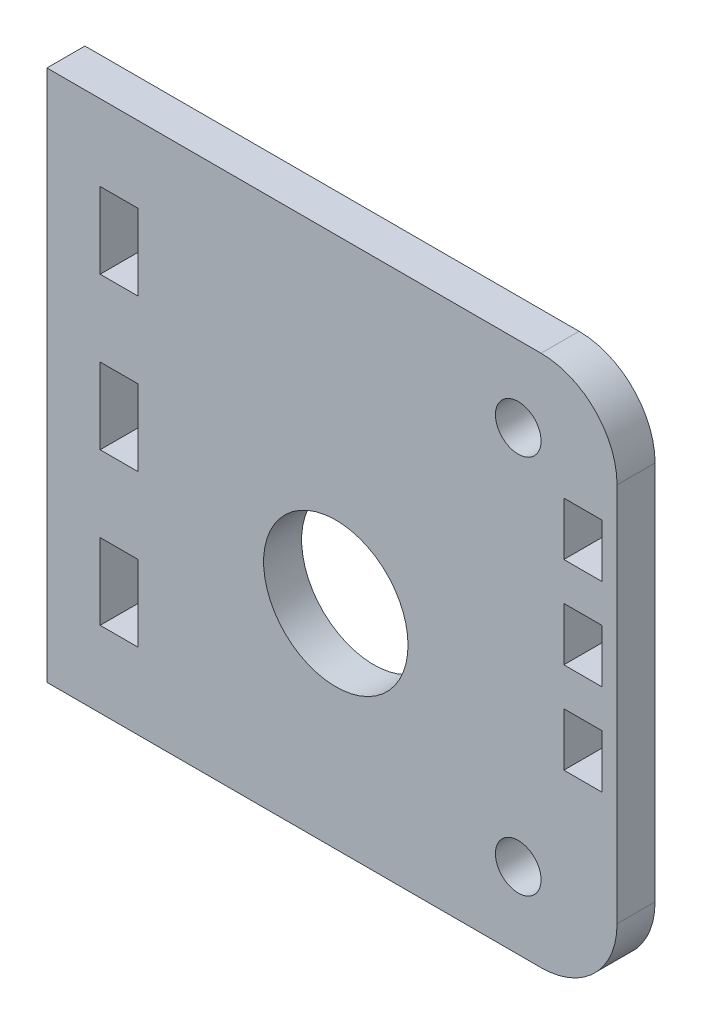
ISO-10303-21;
HEADER;
FILE_DESCRIPTION(('STEP AP214'),'2;1');
FILE_NAME('part.step','',(''),(''),'','','');
FILE_SCHEMA(('AUTOMOTIVE_DESIGN { 1 0 10303 214 1 1 1 1 }'));
ENDSEC;
DATA;
#1=APPLICATION_CONTEXT('core data for automotive mechanical design processes');
#2=APPLICATION_PROTOCOL_DEFINITION('international standard','automotive_design',2000,#1);
#3=PRODUCT_CONTEXT('',#1,'mechanical');
#4=PRODUCT('Part','Part','',(#3));
#5=PRODUCT_RELATED_PRODUCT_CATEGORY('part','',(#4));
#6=PRODUCT_DEFINITION_FORMATION('','',#4);
#7=PRODUCT_DEFINITION_CONTEXT('part definition',#1,'design');
#8=PRODUCT_DEFINITION('design','',#6,#7);
#9=PRODUCT_DEFINITION_SHAPE('','',#8);
#10=(LENGTH_UNIT() NAMED_UNIT(*) SI_UNIT(.MILLI.,.METRE.));
#11=(NAMED_UNIT(*) PLANE_ANGLE_UNIT() SI_UNIT($,.RADIAN.));
#12=(NAMED_UNIT(*) SI_UNIT($,.STERADIAN.) SOLID_ANGLE_UNIT());
#13=UNCERTAINTY_MEASURE_WITH_UNIT(LENGTH_MEASURE(1.E-05),#10,'distance_accuracy_value','');
#14=(GEOMETRIC_REPRESENTATION_CONTEXT(3) GLOBAL_UNCERTAINTY_ASSIGNED_CONTEXT((#13)) GLOBAL_UNIT_ASSIGNED_CONTEXT((#10,
#11,#12)) REPRESENTATION_CONTEXT('',''));
#15=CARTESIAN_POINT('',(0.,0.,0.));
#16=DIRECTION('',(0.,0.,1.));
#17=DIRECTION('',(1.,0.,0.));
#18=AXIS2_PLACEMENT_3D('',#15,#16,#17);
#19=CARTESIAN_POINT('',(0.,0.,5.));
#20=DIRECTION('',(0.,0.,1.));
#21=DIRECTION('',(1.,0.,0.));
#22=AXIS2_PLACEMENT_3D('',#19,#20,#21);
#23=PLANE('',#22);
#24=CARTESIAN_POINT('',(-12.,-7.,5.));
#25=DIRECTION('',(0.,0.,1.));
#26=DIRECTION('',(1.,0.,0.));
#27=AXIS2_PLACEMENT_3D('',#24,#25,#26);
#28=CIRCLE('',#27,9.5);
#29=CARTESIAN_POINT('',(-2.5,-7.,5.));
#30=VERTEX_POINT('',#29);
#31=EDGE_CURVE('E923',#30,#30,#28,.T.);
#32=ORIENTED_EDGE('',*,*,#31,.F.);
#33=EDGE_LOOP('',(#32));
#34=FACE_BOUND('',#33,.T.);
#35=DIRECTION('',(0.,-1.,0.));
#36=VECTOR('',#35,1.);
#37=CARTESIAN_POINT('',(-43.,-15.,5.));
#38=LINE('',#37,#36);
#39=CARTESIAN_POINT('',(-43.,-15.,5.));
#40=VERTEX_POINT('',#39);
#41=CARTESIAN_POINT('',(-43.,-25.,5.));
#42=VERTEX_POINT('',#41);
#43=EDGE_CURVE('E53',#40,#42,#38,.T.);
#44=ORIENTED_EDGE('',*,*,#43,.F.);
#45=DIRECTION('',(-1.,0.,0.));
#46=VECTOR('',#45,1.);
#47=CARTESIAN_POINT('',(-43.,-15.,5.));
#48=LINE('',#47,#46);
#49=CARTESIAN_POINT('',(-38.,-15.,5.));
#50=VERTEX_POINT('',#49);
#51=EDGE_CURVE('E253',#50,#40,#48,.T.);
#52=ORIENTED_EDGE('',*,*,#51,.F.);
#53=DIRECTION('',(0.,1.,0.));
#54=VECTOR('',#53,1.);
#55=CARTESIAN_POINT('',(-38.,-15.,5.));
#56=LINE('',#55,#54);
#57=CARTESIAN_POINT('',(-38.,-25.,5.));
#58=VERTEX_POINT('',#57);
#59=EDGE_CURVE('E238',#58,#50,#56,.T.);
#60=ORIENTED_EDGE('',*,*,#59,.F.);
#61=DIRECTION('',(1.,0.,0.));
#62=VECTOR('',#61,1.);
#63=CARTESIAN_POINT('',(-43.,-25.,5.));
#64=LINE('',#63,#62);
#65=EDGE_CURVE('E247',#42,#58,#64,.T.);
#66=ORIENTED_EDGE('',*,*,#65,.F.);
#67=EDGE_LOOP('',(#44,#52,#60,#66));
#68=FACE_BOUND('',#67,.T.);
#69=DIRECTION('',(0.,-1.,0.));
#70=VECTOR('',#69,1.);
#71=CARTESIAN_POINT('',(-43.,4.99999999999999,5.));
#72=LINE('',#71,#70);
#73=CARTESIAN_POINT('',(-43.,4.99999999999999,5.));
#74=VERTEX_POINT('',#73);
#75=CARTESIAN_POINT('',(-43.,-5.00000000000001,5.));
#76=VERTEX_POINT('',#75);
#77=EDGE_CURVE('E260',#74,#76,#72,.T.);
#78=ORIENTED_EDGE('',*,*,#77,.F.);
#79=DIRECTION('',(-1.,0.,0.));
#80=VECTOR('',#79,1.);
#81=CARTESIAN_POINT('',(-43.,4.99999999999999,5.));
#82=LINE('',#81,#80);
#83=CARTESIAN_POINT('',(-38.,4.99999999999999,5.));
#84=VERTEX_POINT('',#83);
#85=EDGE_CURVE('E270',#84,#74,#82,.T.);
#86=ORIENTED_EDGE('',*,*,#85,.F.);
#87=DIRECTION('',(0.,1.,0.));
#88=VECTOR('',#87,1.);
#89=CARTESIAN_POINT('',(-38.,4.99999999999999,5.));
#90=LINE('',#89,#88);
#91=CARTESIAN_POINT('',(-38.,-5.00000000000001,5.));
#92=VERTEX_POINT('',#91);
#93=EDGE_CURVE('E267',#92,#84,#90,.T.);
#94=ORIENTED_EDGE('',*,*,#93,.F.);
#95=DIRECTION('',(1.,0.,0.));
#96=VECTOR('',#95,1.);
#97=CARTESIAN_POINT('',(-43.,-5.00000000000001,5.));
#98=LINE('',#97,#96);
#99=EDGE_CURVE('E264',#76,#92,#98,.T.);
#100=ORIENTED_EDGE('',*,*,#99,.F.);
#101=EDGE_LOOP('',(#78,#86,#94,#100));
#102=FACE_BOUND('',#101,.T.);
#103=DIRECTION('',(0.,-1.,0.));
#104=VECTOR('',#103,1.);
#105=CARTESIAN_POINT('',(-43.,25.,5.));
#106=LINE('',#105,#104);
#107=CARTESIAN_POINT('',(-43.,25.,5.));
#108=VERTEX_POINT('',#107);
#109=CARTESIAN_POINT('',(-43.,15.,5.));
#110=VERTEX_POINT('',#109);
#111=EDGE_CURVE('E276',#108,#110,#106,.T.);
#112=ORIENTED_EDGE('',*,*,#111,.F.);
#113=DIRECTION('',(-1.,0.,0.));
#114=VECTOR('',#113,1.);
#115=CARTESIAN_POINT('',(-43.,25.,5.));
#116=LINE('',#115,#114);
#117=CARTESIAN_POINT('',(-38.,25.,5.));
#118=VERTEX_POINT('',#117);
#119=EDGE_CURVE('E290',#118,#108,#116,.T.);
#120=ORIENTED_EDGE('',*,*,#119,.F.);
#121=DIRECTION('',(0.,1.,0.));
#122=VECTOR('',#121,1.);
#123=CARTESIAN_POINT('',(-38.,25.,5.));
#124=LINE('',#123,#122);
#125=CARTESIAN_POINT('',(-38.,15.,5.));
#126=VERTEX_POINT('',#125);
#127=EDGE_CURVE('E287',#126,#118,#124,.T.);
#128=ORIENTED_EDGE('',*,*,#127,.F.);
#129=DIRECTION('',(1.,0.,0.));
#130=VECTOR('',#129,1.);
#131=CARTESIAN_POINT('',(-43.,15.,5.));
#132=LINE('',#131,#130);
#133=EDGE_CURVE('E284',#110,#126,#132,.T.);
#134=ORIENTED_EDGE('',*,*,#133,.F.);
#135=EDGE_LOOP('',(#112,#120,#128,#134));
#136=FACE_BOUND('',#135,.T.);
#137=DIRECTION('',(0.,-1.,0.));
#138=VECTOR('',#137,1.);
#139=CARTESIAN_POINT('',(18.,-4.,5.));
#140=LINE('',#139,#138);
#141=CARTESIAN_POINT('',(18.,-4.,5.));
#142=VERTEX_POINT('',#141);
#143=CARTESIAN_POINT('',(18.,-11.,5.));
#144=VERTEX_POINT('',#143);
#145=EDGE_CURVE('E296',#142,#144,#140,.T.);
#146=ORIENTED_EDGE('',*,*,#145,.F.);
#147=DIRECTION('',(-1.,0.,0.));
#148=VECTOR('',#147,1.);
#149=CARTESIAN_POINT('',(18.,-4.,5.));
#150=LINE('',#149,#148);
#151=CARTESIAN_POINT('',(23.,-4.,5.));
#152=VERTEX_POINT('',#151);
#153=EDGE_CURVE('E310',#152,#142,#150,.T.);
#154=ORIENTED_EDGE('',*,*,#153,.F.);
#155=DIRECTION('',(0.,1.,0.));
#156=VECTOR('',#155,1.);
#157=CARTESIAN_POINT('',(23.,-4.,5.));
#158=LINE('',#157,#156);
#159=CARTESIAN_POINT('',(23.,-11.,5.));
#160=VERTEX_POINT('',#159);
#161=EDGE_CURVE('E307',#160,#152,#158,.T.);
#162=ORIENTED_EDGE('',*,*,#161,.F.);
#163=DIRECTION('',(1.,0.,0.));
#164=VECTOR('',#163,1.);
#165=CARTESIAN_POINT('',(18.,-11.,5.));
#166=LINE('',#165,#164);
#167=EDGE_CURVE('E304',#144,#160,#166,.T.);
#168=ORIENTED_EDGE('',*,*,#167,.F.);
#169=EDGE_LOOP('',(#146,#154,#162,#168));
#170=FACE_BOUND('',#169,.T.);
#171=DIRECTION('',(0.,-1.,0.));
#172=VECTOR('',#171,1.);
#173=CARTESIAN_POINT('',(18.,8.,5.));
#174=LINE('',#173,#172);
#175=CARTESIAN_POINT('',(18.,8.,5.));
#176=VERTEX_POINT('',#175);
#177=CARTESIAN_POINT('',(18.,1.,5.));
#178=VERTEX_POINT('',#177);
#179=EDGE_CURVE('E316',#176,#178,#174,.T.);
#180=ORIENTED_EDGE('',*,*,#179,.F.);
#181=DIRECTION('',(-1.,0.,0.));
#182=VECTOR('',#181,1.);
#183=CARTESIAN_POINT('',(18.,8.,5.));
#184=LINE('',#183,#182);
#185=CARTESIAN_POINT('',(23.,8.,5.));
#186=VERTEX_POINT('',#185);
#187=EDGE_CURVE('E330',#186,#176,#184,.T.);
#188=ORIENTED_EDGE('',*,*,#187,.F.);
#189=DIRECTION('',(0.,1.,0.));
#190=VECTOR('',#189,1.);
#191=CARTESIAN_POINT('',(23.,8.,5.));
#192=LINE('',#191,#190);
#193=CARTESIAN_POINT('',(23.,1.,5.));
#194=VERTEX_POINT('',#193);
#195=EDGE_CURVE('E327',#194,#186,#192,.T.);
#196=ORIENTED_EDGE('',*,*,#195,.F.);
#197=DIRECTION('',(1.,0.,0.));
#198=VECTOR('',#197,1.);
#199=CARTESIAN_POINT('',(18.,1.,5.));
#200=LINE('',#199,#198);
#201=EDGE_CURVE('E324',#178,#194,#200,.T.);
#202=ORIENTED_EDGE('',*,*,#201,.F.);
#203=EDGE_LOOP('',(#180,#188,#196,#202));
#204=FACE_BOUND('',#203,.T.);
#205=DIRECTION('',(0.,-1.,0.));
#206=VECTOR('',#205,1.);
#207=CARTESIAN_POINT('',(18.,20.,5.));
#208=LINE('',#207,#206);
#209=CARTESIAN_POINT('',(18.,20.,5.));
#210=VERTEX_POINT('',#209);
#211=CARTESIAN_POINT('',(18.,13.,5.));
#212=VERTEX_POINT('',#211);
#213=EDGE_CURVE('E336',#210,#212,#208,.T.);
#214=ORIENTED_EDGE('',*,*,#213,.F.);
#215=DIRECTION('',(-1.,0.,0.));
#216=VECTOR('',#215,1.);
#217=CARTESIAN_POINT('',(18.,20.,5.));
#218=LINE('',#217,#216);
#219=CARTESIAN_POINT('',(23.,20.,5.));
#220=VERTEX_POINT('',#219);
#221=EDGE_CURVE('E350',#220,#210,#218,.T.);
#222=ORIENTED_EDGE('',*,*,#221,.F.);
#223=DIRECTION('',(0.,1.,0.));
#224=VECTOR('',#223,1.);
#225=CARTESIAN_POINT('',(23.,20.,5.));
#226=LINE('',#225,#224);
#227=CARTESIAN_POINT('',(23.,13.,5.));
#228=VERTEX_POINT('',#227);
#229=EDGE_CURVE('E347',#228,#220,#226,.T.);
#230=ORIENTED_EDGE('',*,*,#229,.F.);
#231=DIRECTION('',(1.,0.,0.));
#232=VECTOR('',#231,1.);
#233=CARTESIAN_POINT('',(18.,13.,5.));
#234=LINE('',#233,#232);
#235=EDGE_CURVE('E344',#212,#228,#234,.T.);
#236=ORIENTED_EDGE('',*,*,#235,.F.);
#237=EDGE_LOOP('',(#214,#222,#230,#236));
#238=FACE_BOUND('',#237,.T.);
#239=DIRECTION('',(-1.,0.,0.));
#240=VECTOR('',#239,1.);
#241=CARTESIAN_POINT('',(25.,35.,5.));
#242=LINE('',#241,#240);
#243=CARTESIAN_POINT('',(15.,35.,5.));
#244=VERTEX_POINT('',#243);
#245=CARTESIAN_POINT('',(-50.,35.,5.));
#246=VERTEX_POINT('',#245);
#247=EDGE_CURVE('E392',#244,#246,#242,.T.);
#248=ORIENTED_EDGE('',*,*,#247,.T.);
#249=DIRECTION('',(0.,1.,0.));
#250=VECTOR('',#249,1.);
#251=CARTESIAN_POINT('',(-50.,-35.,5.));
#252=LINE('',#251,#250);
#253=CARTESIAN_POINT('',(-50.,-35.,5.));
#254=VERTEX_POINT('',#253);
#255=EDGE_CURVE('E368',#254,#246,#252,.T.);
#256=ORIENTED_EDGE('',*,*,#255,.F.);
#257=DIRECTION('',(-1.,0.,0.));
#258=VECTOR('',#257,1.);
#259=CARTESIAN_POINT('',(25.,-35.,5.));
#260=LINE('',#259,#258);
#261=CARTESIAN_POINT('',(15.,-35.,5.));
#262=VERTEX_POINT('',#261);
#263=EDGE_CURVE('E398',#262,#254,#260,.T.);
#264=ORIENTED_EDGE('',*,*,#263,.F.);
#265=CARTESIAN_POINT('',(15.,-25.,5.));
#266=DIRECTION('',(0.,0.,1.));
#267=DIRECTION('',(1.,0.,0.));
#268=AXIS2_PLACEMENT_3D('',#265,#266,#267);
#269=CIRCLE('',#268,10.);
#270=CARTESIAN_POINT('',(25.,-25.,5.));
#271=VERTEX_POINT('',#270);
#272=EDGE_CURVE('E406',#262,#271,#269,.T.);
#273=ORIENTED_EDGE('',*,*,#272,.T.);
#274=DIRECTION('',(0.,-1.,0.));
#275=VECTOR('',#274,1.);
#276=CARTESIAN_POINT('',(25.,35.,5.));
#277=LINE('',#276,#275);
#278=CARTESIAN_POINT('',(25.,25.,5.));
#279=VERTEX_POINT('',#278);
#280=EDGE_CURVE('E384',#279,#271,#277,.T.);
#281=ORIENTED_EDGE('',*,*,#280,.F.);
#282=CARTESIAN_POINT('',(15.,25.,5.));
#283=DIRECTION('',(0.,0.,1.));
#284=DIRECTION('',(1.,0.,0.));
#285=AXIS2_PLACEMENT_3D('',#282,#283,#284);
#286=CIRCLE('',#285,10.);
#287=EDGE_CURVE('E408',#279,#244,#286,.T.);
#288=ORIENTED_EDGE('',*,*,#287,.T.);
#289=EDGE_LOOP('',(#248,#256,#264,#273,#281,#288));
#290=FACE_BOUND('',#289,.T.);
#291=CARTESIAN_POINT('',(12.,-25.,5.));
#292=DIRECTION('',(0.,0.,1.));
#293=DIRECTION('',(1.,0.,0.));
#294=AXIS2_PLACEMENT_3D('',#291,#292,#293);
#295=CIRCLE('',#294,3.);
#296=CARTESIAN_POINT('',(15.,-25.,5.));
#297=VERTEX_POINT('',#296);
#298=EDGE_CURVE('E374',#297,#297,#295,.T.);
#299=ORIENTED_EDGE('',*,*,#298,.F.);
#300=EDGE_LOOP('',(#299));
#301=FACE_BOUND('',#300,.T.);
#302=CARTESIAN_POINT('',(12.,25.,5.));
#303=DIRECTION('',(0.,0.,1.));
#304=DIRECTION('',(1.,0.,0.));
#305=AXIS2_PLACEMENT_3D('',#302,#303,#304);
#306=CIRCLE('',#305,3.);
#307=CARTESIAN_POINT('',(15.,25.,5.));
#308=VERTEX_POINT('',#307);
#309=EDGE_CURVE('E378',#308,#308,#306,.T.);
#310=ORIENTED_EDGE('',*,*,#309,.F.);
#311=EDGE_LOOP('',(#310));
#312=FACE_BOUND('',#311,.T.);
#313=ADVANCED_FACE('F37',(#34,#68,#102,#136,#170,#204,#238,#290,#301,#312),#23,.T.);
#314=CARTESIAN_POINT('',(0.,0.,0.));
#315=DIRECTION('',(0.,0.,1.));
#316=DIRECTION('',(1.,0.,0.));
#317=AXIS2_PLACEMENT_3D('',#314,#315,#316);
#318=PLANE('',#317);
#319=CARTESIAN_POINT('',(-12.,-7.,0.));
#320=DIRECTION('',(0.,0.,1.));
#321=DIRECTION('',(1.,0.,0.));
#322=AXIS2_PLACEMENT_3D('',#319,#320,#321);
#323=CIRCLE('',#322,9.5);
#324=CARTESIAN_POINT('',(-2.5,-7.,0.));
#325=VERTEX_POINT('',#324);
#326=EDGE_CURVE('E41',#325,#325,#323,.T.);
#327=ORIENTED_EDGE('',*,*,#326,.T.);
#328=EDGE_LOOP('',(#327));
#329=FACE_BOUND('',#328,.T.);
#330=DIRECTION('',(-1.,0.,0.));
#331=VECTOR('',#330,1.);
#332=CARTESIAN_POINT('',(0.,-15.,0.));
#333=LINE('',#332,#331);
#334=CARTESIAN_POINT('',(-38.,-15.,0.));
#335=VERTEX_POINT('',#334);
#336=CARTESIAN_POINT('',(-43.,-15.,0.));
#337=VERTEX_POINT('',#336);
#338=EDGE_CURVE('E46',#335,#337,#333,.T.);
#339=ORIENTED_EDGE('',*,*,#338,.T.);
#340=DIRECTION('',(0.,-1.,0.));
#341=VECTOR('',#340,1.);
#342=CARTESIAN_POINT('',(-43.,0.,0.));
#343=LINE('',#342,#341);
#344=CARTESIAN_POINT('',(-43.,-25.,0.));
#345=VERTEX_POINT('',#344);
#346=EDGE_CURVE('E11',#337,#345,#343,.T.);
#347=ORIENTED_EDGE('',*,*,#346,.T.);
#348=DIRECTION('',(1.,0.,0.));
#349=VECTOR('',#348,1.);
#350=CARTESIAN_POINT('',(0.,-25.,0.));
#351=LINE('',#350,#349);
#352=CARTESIAN_POINT('',(-38.,-25.,0.));
#353=VERTEX_POINT('',#352);
#354=EDGE_CURVE('E478',#345,#353,#351,.T.);
#355=ORIENTED_EDGE('',*,*,#354,.T.);
#356=DIRECTION('',(0.,1.,0.));
#357=VECTOR('',#356,1.);
#358=CARTESIAN_POINT('',(-38.,0.,0.));
#359=LINE('',#358,#357);
#360=EDGE_CURVE('E241',#353,#335,#359,.T.);
#361=ORIENTED_EDGE('',*,*,#360,.T.);
#362=EDGE_LOOP('',(#339,#347,#355,#361));
#363=FACE_BOUND('',#362,.T.);
#364=DIRECTION('',(-1.,0.,0.));
#365=VECTOR('',#364,1.);
#366=CARTESIAN_POINT('',(0.,4.99999999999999,0.));
#367=LINE('',#366,#365);
#368=CARTESIAN_POINT('',(-38.,4.99999999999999,0.));
#369=VERTEX_POINT('',#368);
#370=CARTESIAN_POINT('',(-43.,4.99999999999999,0.));
#371=VERTEX_POINT('',#370);
#372=EDGE_CURVE('E472',#369,#371,#367,.T.);
#373=ORIENTED_EDGE('',*,*,#372,.T.);
#374=DIRECTION('',(0.,-1.,0.));
#375=VECTOR('',#374,1.);
#376=CARTESIAN_POINT('',(-43.,0.,0.));
#377=LINE('',#376,#375);
#378=CARTESIAN_POINT('',(-43.,-5.00000000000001,0.));
#379=VERTEX_POINT('',#378);
#380=EDGE_CURVE('E475',#371,#379,#377,.T.);
#381=ORIENTED_EDGE('',*,*,#380,.T.);
#382=DIRECTION('',(1.,0.,0.));
#383=VECTOR('',#382,1.);
#384=CARTESIAN_POINT('',(0.,-5.00000000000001,0.));
#385=LINE('',#384,#383);
#386=CARTESIAN_POINT('',(-38.,-5.00000000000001,0.));
#387=VERTEX_POINT('',#386);
#388=EDGE_CURVE('E466',#379,#387,#385,.T.);
#389=ORIENTED_EDGE('',*,*,#388,.T.);
#390=DIRECTION('',(0.,1.,0.));
#391=VECTOR('',#390,1.);
#392=CARTESIAN_POINT('',(-38.,0.,0.));
#393=LINE('',#392,#391);
#394=EDGE_CURVE('E469',#387,#369,#393,.T.);
#395=ORIENTED_EDGE('',*,*,#394,.T.);
#396=EDGE_LOOP('',(#373,#381,#389,#395));
#397=FACE_BOUND('',#396,.T.);
#398=DIRECTION('',(-1.,0.,0.));
#399=VECTOR('',#398,1.);
#400=CARTESIAN_POINT('',(0.,25.,0.));
#401=LINE('',#400,#399);
#402=CARTESIAN_POINT('',(-38.,25.,0.));
#403=VERTEX_POINT('',#402);
#404=CARTESIAN_POINT('',(-43.,25.,0.));
#405=VERTEX_POINT('',#404);
#406=EDGE_CURVE('E460',#403,#405,#401,.T.);
#407=ORIENTED_EDGE('',*,*,#406,.T.);
#408=DIRECTION('',(0.,-1.,0.));
#409=VECTOR('',#408,1.);
#410=CARTESIAN_POINT('',(-43.,0.,0.));
#411=LINE('',#410,#409);
#412=CARTESIAN_POINT('',(-43.,15.,0.));
#413=VERTEX_POINT('',#412);
#414=EDGE_CURVE('E463',#405,#413,#411,.T.);
#415=ORIENTED_EDGE('',*,*,#414,.T.);
#416=DIRECTION('',(1.,0.,0.));
#417=VECTOR('',#416,1.);
#418=CARTESIAN_POINT('',(0.,15.,0.));
#419=LINE('',#418,#417);
#420=CARTESIAN_POINT('',(-38.,15.,0.));
#421=VERTEX_POINT('',#420);
#422=EDGE_CURVE('E454',#413,#421,#419,.T.);
#423=ORIENTED_EDGE('',*,*,#422,.T.);
#424=DIRECTION('',(0.,1.,0.));
#425=VECTOR('',#424,1.);
#426=CARTESIAN_POINT('',(-38.,0.,0.));
#427=LINE('',#426,#425);
#428=EDGE_CURVE('E457',#421,#403,#427,.T.);
#429=ORIENTED_EDGE('',*,*,#428,.T.);
#430=EDGE_LOOP('',(#407,#415,#423,#429));
#431=FACE_BOUND('',#430,.T.);
#432=DIRECTION('',(-1.,0.,0.));
#433=VECTOR('',#432,1.);
#434=CARTESIAN_POINT('',(0.,-3.99999999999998,0.));
#435=LINE('',#434,#433);
#436=CARTESIAN_POINT('',(23.,-4.,0.));
#437=VERTEX_POINT('',#436);
#438=CARTESIAN_POINT('',(18.,-4.,0.));
#439=VERTEX_POINT('',#438);
#440=EDGE_CURVE('E448',#437,#439,#435,.T.);
#441=ORIENTED_EDGE('',*,*,#440,.T.);
#442=DIRECTION('',(0.,-1.,0.));
#443=VECTOR('',#442,1.);
#444=CARTESIAN_POINT('',(18.,0.,0.));
#445=LINE('',#444,#443);
#446=CARTESIAN_POINT('',(18.,-11.,0.));
#447=VERTEX_POINT('',#446);
#448=EDGE_CURVE('E451',#439,#447,#445,.T.);
#449=ORIENTED_EDGE('',*,*,#448,.T.);
#450=DIRECTION('',(1.,0.,0.));
#451=VECTOR('',#450,1.);
#452=CARTESIAN_POINT('',(0.,-11.,0.));
#453=LINE('',#452,#451);
#454=CARTESIAN_POINT('',(23.,-11.,0.));
#455=VERTEX_POINT('',#454);
#456=EDGE_CURVE('E442',#447,#455,#453,.T.);
#457=ORIENTED_EDGE('',*,*,#456,.T.);
#458=DIRECTION('',(0.,1.,0.));
#459=VECTOR('',#458,1.);
#460=CARTESIAN_POINT('',(23.,0.,0.));
#461=LINE('',#460,#459);
#462=EDGE_CURVE('E445',#455,#437,#461,.T.);
#463=ORIENTED_EDGE('',*,*,#462,.T.);
#464=EDGE_LOOP('',(#441,#449,#457,#463));
#465=FACE_BOUND('',#464,.T.);
#466=DIRECTION('',(-1.,0.,0.));
#467=VECTOR('',#466,1.);
#468=CARTESIAN_POINT('',(0.,8.00000000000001,0.));
#469=LINE('',#468,#467);
#470=CARTESIAN_POINT('',(23.,8.,0.));
#471=VERTEX_POINT('',#470);
#472=CARTESIAN_POINT('',(18.,8.,0.));
#473=VERTEX_POINT('',#472);
#474=EDGE_CURVE('E436',#471,#473,#469,.T.);
#475=ORIENTED_EDGE('',*,*,#474,.T.);
#476=DIRECTION('',(0.,-1.,0.));
#477=VECTOR('',#476,1.);
#478=CARTESIAN_POINT('',(18.,0.,0.));
#479=LINE('',#478,#477);
#480=CARTESIAN_POINT('',(18.,1.,0.));
#481=VERTEX_POINT('',#480);
#482=EDGE_CURVE('E439',#473,#481,#479,.T.);
#483=ORIENTED_EDGE('',*,*,#482,.T.);
#484=DIRECTION('',(1.,0.,0.));
#485=VECTOR('',#484,1.);
#486=CARTESIAN_POINT('',(0.,1.,0.));
#487=LINE('',#486,#485);
#488=CARTESIAN_POINT('',(23.,1.,0.));
#489=VERTEX_POINT('',#488);
#490=EDGE_CURVE('E430',#481,#489,#487,.T.);
#491=ORIENTED_EDGE('',*,*,#490,.T.);
#492=DIRECTION('',(0.,1.,0.));
#493=VECTOR('',#492,1.);
#494=CARTESIAN_POINT('',(23.,0.,0.));
#495=LINE('',#494,#493);
#496=EDGE_CURVE('E433',#489,#471,#495,.T.);
#497=ORIENTED_EDGE('',*,*,#496,.T.);
#498=EDGE_LOOP('',(#475,#483,#491,#497));
#499=FACE_BOUND('',#498,.T.);
#500=DIRECTION('',(-1.,0.,0.));
#501=VECTOR('',#500,1.);
#502=CARTESIAN_POINT('',(0.,20.,0.));
#503=LINE('',#502,#501);
#504=CARTESIAN_POINT('',(23.,20.,0.));
#505=VERTEX_POINT('',#504);
#506=CARTESIAN_POINT('',(18.,20.,0.));
#507=VERTEX_POINT('',#506);
#508=EDGE_CURVE('E424',#505,#507,#503,.T.);
#509=ORIENTED_EDGE('',*,*,#508,.T.);
#510=DIRECTION('',(0.,-1.,0.));
#511=VECTOR('',#510,1.);
#512=CARTESIAN_POINT('',(18.,0.,0.));
#513=LINE('',#512,#511);
#514=CARTESIAN_POINT('',(18.,13.,0.));
#515=VERTEX_POINT('',#514);
#516=EDGE_CURVE('E427',#507,#515,#513,.T.);
#517=ORIENTED_EDGE('',*,*,#516,.T.);
#518=DIRECTION('',(1.,0.,0.));
#519=VECTOR('',#518,1.);
#520=CARTESIAN_POINT('',(0.,13.,0.));
#521=LINE('',#520,#519);
#522=CARTESIAN_POINT('',(23.,13.,0.));
#523=VERTEX_POINT('',#522);
#524=EDGE_CURVE('E418',#515,#523,#521,.T.);
#525=ORIENTED_EDGE('',*,*,#524,.T.);
#526=DIRECTION('',(0.,1.,0.));
#527=VECTOR('',#526,1.);
#528=CARTESIAN_POINT('',(23.,0.,0.));
#529=LINE('',#528,#527);
#530=EDGE_CURVE('E421',#523,#505,#529,.T.);
#531=ORIENTED_EDGE('',*,*,#530,.T.);
#532=EDGE_LOOP('',(#509,#517,#525,#531));
#533=FACE_BOUND('',#532,.T.);
#534=CARTESIAN_POINT('',(12.,-25.,0.));
#535=DIRECTION('',(0.,0.,1.));
#536=DIRECTION('',(1.,0.,0.));
#537=AXIS2_PLACEMENT_3D('',#534,#535,#536);
#538=CIRCLE('',#537,3.);
#539=CARTESIAN_POINT('',(15.,-25.,0.));
#540=VERTEX_POINT('',#539);
#541=EDGE_CURVE('E375',#540,#540,#538,.T.);
#542=ORIENTED_EDGE('',*,*,#541,.T.);
#543=EDGE_LOOP('',(#542));
#544=FACE_BOUND('',#543,.T.);
#545=CARTESIAN_POINT('',(12.,25.,0.));
#546=DIRECTION('',(0.,0.,1.));
#547=DIRECTION('',(1.,0.,0.));
#548=AXIS2_PLACEMENT_3D('',#545,#546,#547);
#549=CIRCLE('',#548,3.);
#550=CARTESIAN_POINT('',(15.,25.,0.));
#551=VERTEX_POINT('',#550);
#552=EDGE_CURVE('E381',#551,#551,#549,.T.);
#553=ORIENTED_EDGE('',*,*,#552,.T.);
#554=EDGE_LOOP('',(#553));
#555=FACE_BOUND('',#554,.T.);
#556=DIRECTION('',(-1.,0.,0.));
#557=VECTOR('',#556,1.);
#558=CARTESIAN_POINT('',(25.,-35.,0.));
#559=LINE('',#558,#557);
#560=CARTESIAN_POINT('',(15.,-35.,0.));
#561=VERTEX_POINT('',#560);
#562=CARTESIAN_POINT('',(-50.,-35.,0.));
#563=VERTEX_POINT('',#562);
#564=EDGE_CURVE('E396',#561,#563,#559,.T.);
#565=ORIENTED_EDGE('',*,*,#564,.T.);
#566=DIRECTION('',(0.,-1.,0.));
#567=VECTOR('',#566,1.);
#568=CARTESIAN_POINT('',(-50.,35.,0.));
#569=LINE('',#568,#567);
#570=CARTESIAN_POINT('',(-50.,35.,0.));
#571=VERTEX_POINT('',#570);
#572=EDGE_CURVE('E356',#571,#563,#569,.T.);
#573=ORIENTED_EDGE('',*,*,#572,.F.);
#574=DIRECTION('',(-1.,0.,0.));
#575=VECTOR('',#574,1.);
#576=CARTESIAN_POINT('',(25.,35.,0.));
#577=LINE('',#576,#575);
#578=CARTESIAN_POINT('',(15.,35.,0.));
#579=VERTEX_POINT('',#578);
#580=EDGE_CURVE('E394',#579,#571,#577,.T.);
#581=ORIENTED_EDGE('',*,*,#580,.F.);
#582=CARTESIAN_POINT('',(15.,25.,0.));
#583=DIRECTION('',(0.,0.,1.));
#584=DIRECTION('',(1.,0.,0.));
#585=AXIS2_PLACEMENT_3D('',#582,#583,#584);
#586=CIRCLE('',#585,10.);
#587=CARTESIAN_POINT('',(25.,25.,0.));
#588=VERTEX_POINT('',#587);
#589=EDGE_CURVE('E414',#579,#588,#586,.F.);
#590=ORIENTED_EDGE('',*,*,#589,.T.);
#591=DIRECTION('',(0.,1.,0.));
#592=VECTOR('',#591,1.);
#593=CARTESIAN_POINT('',(25.,35.,0.));
#594=LINE('',#593,#592);
#595=CARTESIAN_POINT('',(25.,-25.,0.));
#596=VERTEX_POINT('',#595);
#597=EDGE_CURVE('E389',#596,#588,#594,.T.);
#598=ORIENTED_EDGE('',*,*,#597,.F.);
#599=CARTESIAN_POINT('',(15.,-25.,0.));
#600=DIRECTION('',(0.,0.,1.));
#601=DIRECTION('',(1.,0.,0.));
#602=AXIS2_PLACEMENT_3D('',#599,#600,#601);
#603=CIRCLE('',#602,10.);
#604=EDGE_CURVE('E412',#596,#561,#603,.F.);
#605=ORIENTED_EDGE('',*,*,#604,.T.);
#606=EDGE_LOOP('',(#565,#573,#581,#590,#598,#605));
#607=FACE_BOUND('',#606,.T.);
#608=ADVANCED_FACE('F483',(#329,#363,#397,#431,#465,#499,#533,#544,#555,#607),#318,.F.);
#609=CARTESIAN_POINT('',(25.,-35.,5.));
#610=DIRECTION('',(0.,1.,0.));
#611=DIRECTION('',(0.,0.,1.));
#612=AXIS2_PLACEMENT_3D('',#609,#610,#611);
#613=PLANE('',#612);
#614=ORIENTED_EDGE('',*,*,#564,.F.);
#615=DIRECTION('',(0.,0.,-1.));
#616=VECTOR('',#615,1.);
#617=CARTESIAN_POINT('',(15.,-35.,5.));
#618=LINE('',#617,#616);
#619=EDGE_CURVE('E416',#561,#262,#618,.F.);
#620=ORIENTED_EDGE('',*,*,#619,.T.);
#621=ORIENTED_EDGE('',*,*,#263,.T.);
#622=DIRECTION('',(0.,0.,1.));
#623=VECTOR('',#622,1.);
#624=CARTESIAN_POINT('',(-50.,-35.,0.));
#625=LINE('',#624,#623);
#626=EDGE_CURVE('E365',#563,#254,#625,.T.);
#627=ORIENTED_EDGE('',*,*,#626,.F.);
#628=EDGE_LOOP('',(#614,#620,#621,#627));
#629=FACE_BOUND('',#628,.T.);
#630=ADVANCED_FACE('F508',(#629),#613,.F.);
#631=CARTESIAN_POINT('',(25.,35.,5.));
#632=DIRECTION('',(0.,-1.,0.));
#633=DIRECTION('',(0.,0.,-1.));
#634=AXIS2_PLACEMENT_3D('',#631,#632,#633);
#635=PLANE('',#634);
#636=ORIENTED_EDGE('',*,*,#247,.F.);
#637=DIRECTION('',(0.,0.,1.));
#638=VECTOR('',#637,1.);
#639=CARTESIAN_POINT('',(15.,35.,0.));
#640=LINE('',#639,#638);
#641=EDGE_CURVE('E410',#244,#579,#640,.F.);
#642=ORIENTED_EDGE('',*,*,#641,.T.);
#643=ORIENTED_EDGE('',*,*,#580,.T.);
#644=DIRECTION('',(0.,0.,-1.));
#645=VECTOR('',#644,1.);
#646=CARTESIAN_POINT('',(-50.,35.,5.));
#647=LINE('',#646,#645);
#648=EDGE_CURVE('E371',#246,#571,#647,.T.);
#649=ORIENTED_EDGE('',*,*,#648,.F.);
#650=EDGE_LOOP('',(#636,#642,#643,#649));
#651=FACE_BOUND('',#650,.T.);
#652=ADVANCED_FACE('F549',(#651),#635,.F.);
#653=CARTESIAN_POINT('',(25.,0.,0.));
#654=DIRECTION('',(1.,0.,0.));
#655=DIRECTION('',(0.,0.,-1.));
#656=AXIS2_PLACEMENT_3D('',#653,#654,#655);
#657=PLANE('',#656);
#658=ORIENTED_EDGE('',*,*,#597,.T.);
#659=DIRECTION('',(0.,0.,1.));
#660=VECTOR('',#659,1.);
#661=CARTESIAN_POINT('',(25.,25.,5.));
#662=LINE('',#661,#660);
#663=EDGE_CURVE('E403',#588,#279,#662,.T.);
#664=ORIENTED_EDGE('',*,*,#663,.T.);
#665=ORIENTED_EDGE('',*,*,#280,.T.);
#666=DIRECTION('',(0.,0.,-1.));
#667=VECTOR('',#666,1.);
#668=CARTESIAN_POINT('',(25.,-25.,0.));
#669=LINE('',#668,#667);
#670=EDGE_CURVE('E400',#271,#596,#669,.T.);
#671=ORIENTED_EDGE('',*,*,#670,.T.);
#672=EDGE_LOOP('',(#658,#664,#665,#671));
#673=FACE_BOUND('',#672,.T.);
#674=ADVANCED_FACE('F535',(#673),#657,.T.);
#675=CARTESIAN_POINT('',(12.,25.,0.));
#676=DIRECTION('',(0.,0.,1.));
#677=DIRECTION('',(1.,0.,0.));
#678=AXIS2_PLACEMENT_3D('',#675,#676,#677);
#679=CYLINDRICAL_SURFACE('',#678,3.);
#680=ORIENTED_EDGE('',*,*,#552,.F.);
#681=EDGE_LOOP('',(#680));
#682=FACE_BOUND('',#681,.T.);
#683=ORIENTED_EDGE('',*,*,#309,.T.);
#684=EDGE_LOOP('',(#683));
#685=FACE_BOUND('',#684,.T.);
#686=ADVANCED_FACE('F524',(#682,#685),#679,.F.);
#687=CARTESIAN_POINT('',(12.,-25.,0.));
#688=DIRECTION('',(0.,0.,1.));
#689=DIRECTION('',(1.,0.,0.));
#690=AXIS2_PLACEMENT_3D('',#687,#688,#689);
#691=CYLINDRICAL_SURFACE('',#690,3.);
#692=ORIENTED_EDGE('',*,*,#541,.F.);
#693=EDGE_LOOP('',(#692));
#694=FACE_BOUND('',#693,.T.);
#695=ORIENTED_EDGE('',*,*,#298,.T.);
#696=EDGE_LOOP('',(#695));
#697=FACE_BOUND('',#696,.T.);
#698=ADVANCED_FACE('F516',(#694,#697),#691,.F.);
#699=CARTESIAN_POINT('',(15.,25.,0.));
#700=DIRECTION('',(0.,0.,-1.));
#701=DIRECTION('',(-1.,0.,0.));
#702=AXIS2_PLACEMENT_3D('',#699,#700,#701);
#703=CYLINDRICAL_SURFACE('',#702,10.);
#704=ORIENTED_EDGE('',*,*,#589,.F.);
#705=ORIENTED_EDGE('',*,*,#641,.F.);
#706=ORIENTED_EDGE('',*,*,#287,.F.);
#707=ORIENTED_EDGE('',*,*,#663,.F.);
#708=EDGE_LOOP('',(#704,#705,#706,#707));
#709=FACE_BOUND('',#708,.T.);
#710=ADVANCED_FACE('F514',(#709),#703,.T.);
#711=CARTESIAN_POINT('',(15.,-25.,0.));
#712=DIRECTION('',(0.,0.,1.));
#713=DIRECTION('',(1.,0.,0.));
#714=AXIS2_PLACEMENT_3D('',#711,#712,#713);
#715=CYLINDRICAL_SURFACE('',#714,10.);
#716=ORIENTED_EDGE('',*,*,#272,.F.);
#717=ORIENTED_EDGE('',*,*,#619,.F.);
#718=ORIENTED_EDGE('',*,*,#604,.F.);
#719=ORIENTED_EDGE('',*,*,#670,.F.);
#720=EDGE_LOOP('',(#716,#717,#718,#719));
#721=FACE_BOUND('',#720,.T.);
#722=ADVANCED_FACE('F39',(#721),#715,.T.);
#723=CARTESIAN_POINT('',(-50.,0.,0.));
#724=DIRECTION('',(-1.,0.,0.));
#725=DIRECTION('',(0.,0.,1.));
#726=AXIS2_PLACEMENT_3D('',#723,#724,#725);
#727=PLANE('',#726);
#728=ORIENTED_EDGE('',*,*,#572,.T.);
#729=ORIENTED_EDGE('',*,*,#626,.T.);
#730=ORIENTED_EDGE('',*,*,#255,.T.);
#731=ORIENTED_EDGE('',*,*,#648,.T.);
#732=EDGE_LOOP('',(#728,#729,#730,#731));
#733=FACE_BOUND('',#732,.T.);
#734=ADVANCED_FACE('F522',(#733),#727,.T.);
#735=CARTESIAN_POINT('',(18.,20.,-5.));
#736=DIRECTION('',(-1.,0.,0.));
#737=DIRECTION('',(0.,0.,1.));
#738=AXIS2_PLACEMENT_3D('',#735,#736,#737);
#739=PLANE('',#738);
#740=DIRECTION('',(0.,0.,1.));
#741=VECTOR('',#740,1.);
#742=CARTESIAN_POINT('',(18.,20.,-5.));
#743=LINE('',#742,#741);
#744=EDGE_CURVE('E354',#507,#210,#743,.T.);
#745=ORIENTED_EDGE('',*,*,#744,.T.);
#746=ORIENTED_EDGE('',*,*,#213,.T.);
#747=DIRECTION('',(0.,0.,1.));
#748=VECTOR('',#747,1.);
#749=CARTESIAN_POINT('',(18.,13.,-5.));
#750=LINE('',#749,#748);
#751=EDGE_CURVE('E353',#515,#212,#750,.T.);
#752=ORIENTED_EDGE('',*,*,#751,.F.);
#753=ORIENTED_EDGE('',*,*,#516,.F.);
#754=EDGE_LOOP('',(#745,#746,#752,#753));
#755=FACE_BOUND('',#754,.T.);
#756=ADVANCED_FACE('F794',(#755),#739,.F.);
#757=CARTESIAN_POINT('',(18.,20.,-5.));
#758=DIRECTION('',(0.,1.,0.));
#759=DIRECTION('',(-1.,0.,0.));
#760=AXIS2_PLACEMENT_3D('',#757,#758,#759);
#761=PLANE('',#760);
#762=DIRECTION('',(0.,0.,1.));
#763=VECTOR('',#762,1.);
#764=CARTESIAN_POINT('',(23.,20.,-5.));
#765=LINE('',#764,#763);
#766=EDGE_CURVE('E357',#505,#220,#765,.T.);
#767=ORIENTED_EDGE('',*,*,#766,.T.);
#768=ORIENTED_EDGE('',*,*,#221,.T.);
#769=ORIENTED_EDGE('',*,*,#744,.F.);
#770=ORIENTED_EDGE('',*,*,#508,.F.);
#771=EDGE_LOOP('',(#767,#768,#769,#770));
#772=FACE_BOUND('',#771,.T.);
#773=ADVANCED_FACE('F784',(#772),#761,.F.);
#774=CARTESIAN_POINT('',(23.,20.,-5.));
#775=DIRECTION('',(1.,0.,0.));
#776=DIRECTION('',(0.,0.,-1.));
#777=AXIS2_PLACEMENT_3D('',#774,#775,#776);
#778=PLANE('',#777);
#779=DIRECTION('',(0.,0.,1.));
#780=VECTOR('',#779,1.);
#781=CARTESIAN_POINT('',(23.,13.,-5.));
#782=LINE('',#781,#780);
#783=EDGE_CURVE('E359',#523,#228,#782,.T.);
#784=ORIENTED_EDGE('',*,*,#783,.T.);
#785=ORIENTED_EDGE('',*,*,#229,.T.);
#786=ORIENTED_EDGE('',*,*,#766,.F.);
#787=ORIENTED_EDGE('',*,*,#530,.F.);
#788=EDGE_LOOP('',(#784,#785,#786,#787));
#789=FACE_BOUND('',#788,.T.);
#790=ADVANCED_FACE('F774',(#789),#778,.F.);
#791=CARTESIAN_POINT('',(18.,13.,-5.));
#792=DIRECTION('',(0.,-1.,0.));
#793=DIRECTION('',(0.,0.,-1.));
#794=AXIS2_PLACEMENT_3D('',#791,#792,#793);
#795=PLANE('',#794);
#796=ORIENTED_EDGE('',*,*,#751,.T.);
#797=ORIENTED_EDGE('',*,*,#235,.T.);
#798=ORIENTED_EDGE('',*,*,#783,.F.);
#799=ORIENTED_EDGE('',*,*,#524,.F.);
#800=EDGE_LOOP('',(#796,#797,#798,#799));
#801=FACE_BOUND('',#800,.T.);
#802=ADVANCED_FACE('F764',(#801),#795,.F.);
#803=CARTESIAN_POINT('',(18.,8.,-5.));
#804=DIRECTION('',(-1.,0.,0.));
#805=DIRECTION('',(0.,0.,1.));
#806=AXIS2_PLACEMENT_3D('',#803,#804,#805);
#807=PLANE('',#806);
#808=DIRECTION('',(0.,0.,1.));
#809=VECTOR('',#808,1.);
#810=CARTESIAN_POINT('',(18.,8.,-5.));
#811=LINE('',#810,#809);
#812=EDGE_CURVE('E334',#473,#176,#811,.T.);
#813=ORIENTED_EDGE('',*,*,#812,.T.);
#814=ORIENTED_EDGE('',*,*,#179,.T.);
#815=DIRECTION('',(0.,0.,1.));
#816=VECTOR('',#815,1.);
#817=CARTESIAN_POINT('',(18.,1.,-5.));
#818=LINE('',#817,#816);
#819=EDGE_CURVE('E333',#481,#178,#818,.T.);
#820=ORIENTED_EDGE('',*,*,#819,.F.);
#821=ORIENTED_EDGE('',*,*,#482,.F.);
#822=EDGE_LOOP('',(#813,#814,#820,#821));
#823=FACE_BOUND('',#822,.T.);
#824=ADVANCED_FACE('F754',(#823),#807,.F.);
#825=CARTESIAN_POINT('',(18.,8.,-5.));
#826=DIRECTION('',(0.,1.,0.));
#827=DIRECTION('',(-1.,0.,0.));
#828=AXIS2_PLACEMENT_3D('',#825,#826,#827);
#829=PLANE('',#828);
#830=DIRECTION('',(0.,0.,1.));
#831=VECTOR('',#830,1.);
#832=CARTESIAN_POINT('',(23.,8.,-5.));
#833=LINE('',#832,#831);
#834=EDGE_CURVE('E337',#471,#186,#833,.T.);
#835=ORIENTED_EDGE('',*,*,#834,.T.);
#836=ORIENTED_EDGE('',*,*,#187,.T.);
#837=ORIENTED_EDGE('',*,*,#812,.F.);
#838=ORIENTED_EDGE('',*,*,#474,.F.);
#839=EDGE_LOOP('',(#835,#836,#837,#838));
#840=FACE_BOUND('',#839,.T.);
#841=ADVANCED_FACE('F744',(#840),#829,.F.);
#842=CARTESIAN_POINT('',(23.,8.,-5.));
#843=DIRECTION('',(1.,0.,0.));
#844=DIRECTION('',(0.,0.,-1.));
#845=AXIS2_PLACEMENT_3D('',#842,#843,#844);
#846=PLANE('',#845);
#847=DIRECTION('',(0.,0.,1.));
#848=VECTOR('',#847,1.);
#849=CARTESIAN_POINT('',(23.,1.,-5.));
#850=LINE('',#849,#848);
#851=EDGE_CURVE('E339',#489,#194,#850,.T.);
#852=ORIENTED_EDGE('',*,*,#851,.T.);
#853=ORIENTED_EDGE('',*,*,#195,.T.);
#854=ORIENTED_EDGE('',*,*,#834,.F.);
#855=ORIENTED_EDGE('',*,*,#496,.F.);
#856=EDGE_LOOP('',(#852,#853,#854,#855));
#857=FACE_BOUND('',#856,.T.);
#858=ADVANCED_FACE('F734',(#857),#846,.F.);
#859=CARTESIAN_POINT('',(18.,1.,-5.));
#860=DIRECTION('',(0.,-1.,0.));
#861=DIRECTION('',(0.,0.,-1.));
#862=AXIS2_PLACEMENT_3D('',#859,#860,#861);
#863=PLANE('',#862);
#864=ORIENTED_EDGE('',*,*,#819,.T.);
#865=ORIENTED_EDGE('',*,*,#201,.T.);
#866=ORIENTED_EDGE('',*,*,#851,.F.);
#867=ORIENTED_EDGE('',*,*,#490,.F.);
#868=EDGE_LOOP('',(#864,#865,#866,#867));
#869=FACE_BOUND('',#868,.T.);
#870=ADVANCED_FACE('F724',(#869),#863,.F.);
#871=CARTESIAN_POINT('',(18.,-4.,-5.));
#872=DIRECTION('',(-1.,0.,0.));
#873=DIRECTION('',(0.,0.,1.));
#874=AXIS2_PLACEMENT_3D('',#871,#872,#873);
#875=PLANE('',#874);
#876=DIRECTION('',(0.,0.,1.));
#877=VECTOR('',#876,1.);
#878=CARTESIAN_POINT('',(18.,-4.,-5.));
#879=LINE('',#878,#877);
#880=EDGE_CURVE('E314',#439,#142,#879,.T.);
#881=ORIENTED_EDGE('',*,*,#880,.T.);
#882=ORIENTED_EDGE('',*,*,#145,.T.);
#883=DIRECTION('',(0.,0.,1.));
#884=VECTOR('',#883,1.);
#885=CARTESIAN_POINT('',(18.,-11.,-5.));
#886=LINE('',#885,#884);
#887=EDGE_CURVE('E313',#447,#144,#886,.T.);
#888=ORIENTED_EDGE('',*,*,#887,.F.);
#889=ORIENTED_EDGE('',*,*,#448,.F.);
#890=EDGE_LOOP('',(#881,#882,#888,#889));
#891=FACE_BOUND('',#890,.T.);
#892=ADVANCED_FACE('F714',(#891),#875,.F.);
#893=CARTESIAN_POINT('',(18.,-4.,-5.));
#894=DIRECTION('',(0.,1.,0.));
#895=DIRECTION('',(-1.,0.,0.));
#896=AXIS2_PLACEMENT_3D('',#893,#894,#895);
#897=PLANE('',#896);
#898=DIRECTION('',(0.,0.,1.));
#899=VECTOR('',#898,1.);
#900=CARTESIAN_POINT('',(23.,-4.,-5.));
#901=LINE('',#900,#899);
#902=EDGE_CURVE('E317',#437,#152,#901,.T.);
#903=ORIENTED_EDGE('',*,*,#902,.T.);
#904=ORIENTED_EDGE('',*,*,#153,.T.);
#905=ORIENTED_EDGE('',*,*,#880,.F.);
#906=ORIENTED_EDGE('',*,*,#440,.F.);
#907=EDGE_LOOP('',(#903,#904,#905,#906));
#908=FACE_BOUND('',#907,.T.);
#909=ADVANCED_FACE('F704',(#908),#897,.F.);
#910=CARTESIAN_POINT('',(23.,-4.,-5.));
#911=DIRECTION('',(1.,0.,0.));
#912=DIRECTION('',(0.,0.,-1.));
#913=AXIS2_PLACEMENT_3D('',#910,#911,#912);
#914=PLANE('',#913);
#915=DIRECTION('',(0.,0.,1.));
#916=VECTOR('',#915,1.);
#917=CARTESIAN_POINT('',(23.,-11.,-5.));
#918=LINE('',#917,#916);
#919=EDGE_CURVE('E319',#455,#160,#918,.T.);
#920=ORIENTED_EDGE('',*,*,#919,.T.);
#921=ORIENTED_EDGE('',*,*,#161,.T.);
#922=ORIENTED_EDGE('',*,*,#902,.F.);
#923=ORIENTED_EDGE('',*,*,#462,.F.);
#924=EDGE_LOOP('',(#920,#921,#922,#923));
#925=FACE_BOUND('',#924,.T.);
#926=ADVANCED_FACE('F694',(#925),#914,.F.);
#927=CARTESIAN_POINT('',(18.,-11.,-5.));
#928=DIRECTION('',(0.,-1.,0.));
#929=DIRECTION('',(0.,0.,-1.));
#930=AXIS2_PLACEMENT_3D('',#927,#928,#929);
#931=PLANE('',#930);
#932=ORIENTED_EDGE('',*,*,#887,.T.);
#933=ORIENTED_EDGE('',*,*,#167,.T.);
#934=ORIENTED_EDGE('',*,*,#919,.F.);
#935=ORIENTED_EDGE('',*,*,#456,.F.);
#936=EDGE_LOOP('',(#932,#933,#934,#935));
#937=FACE_BOUND('',#936,.T.);
#938=ADVANCED_FACE('F684',(#937),#931,.F.);
#939=CARTESIAN_POINT('',(-43.,25.,-5.));
#940=DIRECTION('',(-1.,0.,0.));
#941=DIRECTION('',(0.,0.,1.));
#942=AXIS2_PLACEMENT_3D('',#939,#940,#941);
#943=PLANE('',#942);
#944=DIRECTION('',(0.,0.,1.));
#945=VECTOR('',#944,1.);
#946=CARTESIAN_POINT('',(-43.,25.,-5.));
#947=LINE('',#946,#945);
#948=EDGE_CURVE('E294',#405,#108,#947,.T.);
#949=ORIENTED_EDGE('',*,*,#948,.T.);
#950=ORIENTED_EDGE('',*,*,#111,.T.);
#951=DIRECTION('',(0.,0.,1.));
#952=VECTOR('',#951,1.);
#953=CARTESIAN_POINT('',(-43.,15.,-5.));
#954=LINE('',#953,#952);
#955=EDGE_CURVE('E293',#413,#110,#954,.T.);
#956=ORIENTED_EDGE('',*,*,#955,.F.);
#957=ORIENTED_EDGE('',*,*,#414,.F.);
#958=EDGE_LOOP('',(#949,#950,#956,#957));
#959=FACE_BOUND('',#958,.T.);
#960=ADVANCED_FACE('F674',(#959),#943,.F.);
#961=CARTESIAN_POINT('',(-43.,25.,-5.));
#962=DIRECTION('',(0.,1.,0.));
#963=DIRECTION('',(0.,0.,1.));
#964=AXIS2_PLACEMENT_3D('',#961,#962,#963);
#965=PLANE('',#964);
#966=DIRECTION('',(0.,0.,1.));
#967=VECTOR('',#966,1.);
#968=CARTESIAN_POINT('',(-38.,25.,-5.));
#969=LINE('',#968,#967);
#970=EDGE_CURVE('E297',#403,#118,#969,.T.);
#971=ORIENTED_EDGE('',*,*,#970,.T.);
#972=ORIENTED_EDGE('',*,*,#119,.T.);
#973=ORIENTED_EDGE('',*,*,#948,.F.);
#974=ORIENTED_EDGE('',*,*,#406,.F.);
#975=EDGE_LOOP('',(#971,#972,#973,#974));
#976=FACE_BOUND('',#975,.T.);
#977=ADVANCED_FACE('F664',(#976),#965,.F.);
#978=CARTESIAN_POINT('',(-38.,25.,-5.));
#979=DIRECTION('',(1.,0.,0.));
#980=DIRECTION('',(0.,0.,-1.));
#981=AXIS2_PLACEMENT_3D('',#978,#979,#980);
#982=PLANE('',#981);
#983=DIRECTION('',(0.,0.,1.));
#984=VECTOR('',#983,1.);
#985=CARTESIAN_POINT('',(-38.,15.,-5.));
#986=LINE('',#985,#984);
#987=EDGE_CURVE('E299',#421,#126,#986,.T.);
#988=ORIENTED_EDGE('',*,*,#987,.T.);
#989=ORIENTED_EDGE('',*,*,#127,.T.);
#990=ORIENTED_EDGE('',*,*,#970,.F.);
#991=ORIENTED_EDGE('',*,*,#428,.F.);
#992=EDGE_LOOP('',(#988,#989,#990,#991));
#993=FACE_BOUND('',#992,.T.);
#994=ADVANCED_FACE('F654',(#993),#982,.F.);
#995=CARTESIAN_POINT('',(-43.,15.,-5.));
#996=DIRECTION('',(0.,-1.,0.));
#997=DIRECTION('',(0.,0.,-1.));
#998=AXIS2_PLACEMENT_3D('',#995,#996,#997);
#999=PLANE('',#998);
#1000=ORIENTED_EDGE('',*,*,#955,.T.);
#1001=ORIENTED_EDGE('',*,*,#133,.T.);
#1002=ORIENTED_EDGE('',*,*,#987,.F.);
#1003=ORIENTED_EDGE('',*,*,#422,.F.);
#1004=EDGE_LOOP('',(#1000,#1001,#1002,#1003));
#1005=FACE_BOUND('',#1004,.T.);
#1006=ADVANCED_FACE('F644',(#1005),#999,.F.);
#1007=CARTESIAN_POINT('',(-43.,4.99999999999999,-5.));
#1008=DIRECTION('',(-1.,0.,0.));
#1009=DIRECTION('',(0.,0.,1.));
#1010=AXIS2_PLACEMENT_3D('',#1007,#1008,#1009);
#1011=PLANE('',#1010);
#1012=DIRECTION('',(0.,0.,1.));
#1013=VECTOR('',#1012,1.);
#1014=CARTESIAN_POINT('',(-43.,4.99999999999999,-5.));
#1015=LINE('',#1014,#1013);
#1016=EDGE_CURVE('E274',#371,#74,#1015,.T.);
#1017=ORIENTED_EDGE('',*,*,#1016,.T.);
#1018=ORIENTED_EDGE('',*,*,#77,.T.);
#1019=DIRECTION('',(0.,0.,1.));
#1020=VECTOR('',#1019,1.);
#1021=CARTESIAN_POINT('',(-43.,-5.00000000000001,-5.));
#1022=LINE('',#1021,#1020);
#1023=EDGE_CURVE('E273',#379,#76,#1022,.T.);
#1024=ORIENTED_EDGE('',*,*,#1023,.F.);
#1025=ORIENTED_EDGE('',*,*,#380,.F.);
#1026=EDGE_LOOP('',(#1017,#1018,#1024,#1025));
#1027=FACE_BOUND('',#1026,.T.);
#1028=ADVANCED_FACE('F635',(#1027),#1011,.F.);
#1029=CARTESIAN_POINT('',(-43.,4.99999999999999,-5.));
#1030=DIRECTION('',(0.,1.,0.));
#1031=DIRECTION('',(0.,0.,1.));
#1032=AXIS2_PLACEMENT_3D('',#1029,#1030,#1031);
#1033=PLANE('',#1032);
#1034=DIRECTION('',(0.,0.,1.));
#1035=VECTOR('',#1034,1.);
#1036=CARTESIAN_POINT('',(-38.,4.99999999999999,-5.));
#1037=LINE('',#1036,#1035);
#1038=EDGE_CURVE('E277',#369,#84,#1037,.T.);
#1039=ORIENTED_EDGE('',*,*,#1038,.T.);
#1040=ORIENTED_EDGE('',*,*,#85,.T.);
#1041=ORIENTED_EDGE('',*,*,#1016,.F.);
#1042=ORIENTED_EDGE('',*,*,#372,.F.);
#1043=EDGE_LOOP('',(#1039,#1040,#1041,#1042));
#1044=FACE_BOUND('',#1043,.T.);
#1045=ADVANCED_FACE('F625',(#1044),#1033,.F.);
#1046=CARTESIAN_POINT('',(-38.,4.99999999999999,-5.));
#1047=DIRECTION('',(1.,0.,0.));
#1048=DIRECTION('',(0.,0.,-1.));
#1049=AXIS2_PLACEMENT_3D('',#1046,#1047,#1048);
#1050=PLANE('',#1049);
#1051=DIRECTION('',(0.,0.,1.));
#1052=VECTOR('',#1051,1.);
#1053=CARTESIAN_POINT('',(-38.,-5.00000000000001,-5.));
#1054=LINE('',#1053,#1052);
#1055=EDGE_CURVE('E279',#387,#92,#1054,.T.);
#1056=ORIENTED_EDGE('',*,*,#1055,.T.);
#1057=ORIENTED_EDGE('',*,*,#93,.T.);
#1058=ORIENTED_EDGE('',*,*,#1038,.F.);
#1059=ORIENTED_EDGE('',*,*,#394,.F.);
#1060=EDGE_LOOP('',(#1056,#1057,#1058,#1059));
#1061=FACE_BOUND('',#1060,.T.);
#1062=ADVANCED_FACE('F497',(#1061),#1050,.F.);
#1063=CARTESIAN_POINT('',(-43.,-5.00000000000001,-5.));
#1064=DIRECTION('',(0.,-1.,0.));
#1065=DIRECTION('',(0.,0.,-1.));
#1066=AXIS2_PLACEMENT_3D('',#1063,#1064,#1065);
#1067=PLANE('',#1066);
#1068=ORIENTED_EDGE('',*,*,#1023,.T.);
#1069=ORIENTED_EDGE('',*,*,#99,.T.);
#1070=ORIENTED_EDGE('',*,*,#1055,.F.);
#1071=ORIENTED_EDGE('',*,*,#388,.F.);
#1072=EDGE_LOOP('',(#1068,#1069,#1070,#1071));
#1073=FACE_BOUND('',#1072,.T.);
#1074=ADVANCED_FACE('F490',(#1073),#1067,.F.);
#1075=CARTESIAN_POINT('',(-43.,-15.,-5.));
#1076=DIRECTION('',(-1.,0.,0.));
#1077=DIRECTION('',(0.,0.,1.));
#1078=AXIS2_PLACEMENT_3D('',#1075,#1076,#1077);
#1079=PLANE('',#1078);
#1080=DIRECTION('',(0.,0.,1.));
#1081=VECTOR('',#1080,1.);
#1082=CARTESIAN_POINT('',(-43.,-15.,-5.));
#1083=LINE('',#1082,#1081);
#1084=EDGE_CURVE('E258',#337,#40,#1083,.T.);
#1085=ORIENTED_EDGE('',*,*,#1084,.T.);
#1086=ORIENTED_EDGE('',*,*,#43,.T.);
#1087=DIRECTION('',(0.,0.,1.));
#1088=VECTOR('',#1087,1.);
#1089=CARTESIAN_POINT('',(-43.,-25.,-5.));
#1090=LINE('',#1089,#1088);
#1091=EDGE_CURVE('E244',#345,#42,#1090,.T.);
#1092=ORIENTED_EDGE('',*,*,#1091,.F.);
#1093=ORIENTED_EDGE('',*,*,#346,.F.);
#1094=EDGE_LOOP('',(#1085,#1086,#1092,#1093));
#1095=FACE_BOUND('',#1094,.T.);
#1096=ADVANCED_FACE('F488',(#1095),#1079,.F.);
#1097=CARTESIAN_POINT('',(-43.,-15.,-5.));
#1098=DIRECTION('',(0.,1.,0.));
#1099=DIRECTION('',(0.,0.,1.));
#1100=AXIS2_PLACEMENT_3D('',#1097,#1098,#1099);
#1101=PLANE('',#1100);
#1102=DIRECTION('',(0.,0.,1.));
#1103=VECTOR('',#1102,1.);
#1104=CARTESIAN_POINT('',(-38.,-15.,-5.));
#1105=LINE('',#1104,#1103);
#1106=EDGE_CURVE('E243',#335,#50,#1105,.T.);
#1107=ORIENTED_EDGE('',*,*,#1106,.T.);
#1108=ORIENTED_EDGE('',*,*,#51,.T.);
#1109=ORIENTED_EDGE('',*,*,#1084,.F.);
#1110=ORIENTED_EDGE('',*,*,#338,.F.);
#1111=EDGE_LOOP('',(#1107,#1108,#1109,#1110));
#1112=FACE_BOUND('',#1111,.T.);
#1113=ADVANCED_FACE('F487',(#1112),#1101,.F.);
#1114=CARTESIAN_POINT('',(-38.,-15.,-5.));
#1115=DIRECTION('',(1.,0.,0.));
#1116=DIRECTION('',(0.,0.,-1.));
#1117=AXIS2_PLACEMENT_3D('',#1114,#1115,#1116);
#1118=PLANE('',#1117);
#1119=DIRECTION('',(0.,0.,1.));
#1120=VECTOR('',#1119,1.);
#1121=CARTESIAN_POINT('',(-38.,-25.,-5.));
#1122=LINE('',#1121,#1120);
#1123=EDGE_CURVE('E61',#353,#58,#1122,.T.);
#1124=ORIENTED_EDGE('',*,*,#1123,.T.);
#1125=ORIENTED_EDGE('',*,*,#59,.T.);
#1126=ORIENTED_EDGE('',*,*,#1106,.F.);
#1127=ORIENTED_EDGE('',*,*,#360,.F.);
#1128=EDGE_LOOP('',(#1124,#1125,#1126,#1127));
#1129=FACE_BOUND('',#1128,.T.);
#1130=ADVANCED_FACE('F235',(#1129),#1118,.F.);
#1131=CARTESIAN_POINT('',(-43.,-25.,-5.));
#1132=DIRECTION('',(0.,-1.,0.));
#1133=DIRECTION('',(0.,0.,-1.));
#1134=AXIS2_PLACEMENT_3D('',#1131,#1132,#1133);
#1135=PLANE('',#1134);
#1136=ORIENTED_EDGE('',*,*,#1091,.T.);
#1137=ORIENTED_EDGE('',*,*,#65,.T.);
#1138=ORIENTED_EDGE('',*,*,#1123,.F.);
#1139=ORIENTED_EDGE('',*,*,#354,.F.);
#1140=EDGE_LOOP('',(#1136,#1137,#1138,#1139));
#1141=FACE_BOUND('',#1140,.T.);
#1142=ADVANCED_FACE('F248',(#1141),#1135,.F.);
#1143=CARTESIAN_POINT('',(-12.,-7.,-25.));
#1144=DIRECTION('',(0.,0.,1.));
#1145=DIRECTION('',(1.,0.,0.));
#1146=AXIS2_PLACEMENT_3D('',#1143,#1144,#1145);
#1147=CYLINDRICAL_SURFACE('',#1146,9.5);
#1148=ORIENTED_EDGE('',*,*,#31,.T.);
#1149=EDGE_LOOP('',(#1148));
#1150=FACE_BOUND('',#1149,.T.);
#1151=ORIENTED_EDGE('',*,*,#326,.F.);
#1152=EDGE_LOOP('',(#1151));
#1153=FACE_BOUND('',#1152,.T.);
#1154=ADVANCED_FACE('F585',(#1150,#1153),#1147,.F.);
#1155=CLOSED_SHELL('',(#313,#608,#630,#652,#674,#686,#698,#710,#722,#734,#756,#773,#790,#802,
#824,#841,#858,#870,#892,#909,#926,#938,#960,#977,#994,#1006,#1028,#1045,#1062,#1074,#1096,
#1113,#1130,#1142,#1154));
#1156=MANIFOLD_SOLID_BREP('B2',#1155);
#1157=ADVANCED_BREP_SHAPE_REPRESENTATION('',(#18,#1156),#14);
#1158=SHAPE_DEFINITION_REPRESENTATION(#9,#1157);
ENDSEC;
END-ISO-10303-21;
